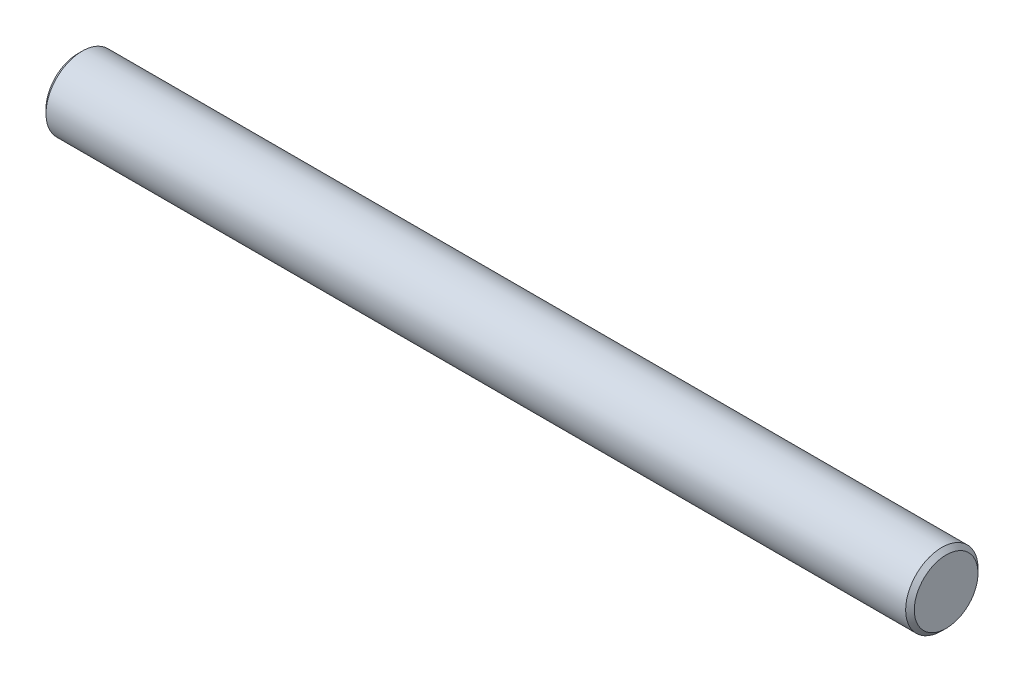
ISO-10303-21;
HEADER;
FILE_DESCRIPTION(('STEP AP214'),'2;1');
FILE_NAME('part.step','',(''),(''),'','','');
FILE_SCHEMA(('AUTOMOTIVE_DESIGN { 1 0 10303 214 1 1 1 1 }'));
ENDSEC;
DATA;
#1=APPLICATION_CONTEXT('core data for automotive mechanical design processes');
#2=APPLICATION_PROTOCOL_DEFINITION('international standard','automotive_design',2000,#1);
#3=PRODUCT_CONTEXT('',#1,'mechanical');
#4=PRODUCT('Part','Part','',(#3));
#5=PRODUCT_RELATED_PRODUCT_CATEGORY('part','',(#4));
#6=PRODUCT_DEFINITION_FORMATION('','',#4);
#7=PRODUCT_DEFINITION_CONTEXT('part definition',#1,'design');
#8=PRODUCT_DEFINITION('design','',#6,#7);
#9=PRODUCT_DEFINITION_SHAPE('','',#8);
#10=(LENGTH_UNIT() NAMED_UNIT(*) SI_UNIT(.MILLI.,.METRE.));
#11=(NAMED_UNIT(*) PLANE_ANGLE_UNIT() SI_UNIT($,.RADIAN.));
#12=(NAMED_UNIT(*) SI_UNIT($,.STERADIAN.) SOLID_ANGLE_UNIT());
#13=UNCERTAINTY_MEASURE_WITH_UNIT(LENGTH_MEASURE(1.E-05),#10,'distance_accuracy_value','');
#14=(GEOMETRIC_REPRESENTATION_CONTEXT(3) GLOBAL_UNCERTAINTY_ASSIGNED_CONTEXT((#13)) GLOBAL_UNIT_ASSIGNED_CONTEXT((#10,
#11,#12)) REPRESENTATION_CONTEXT('',''));
#15=CARTESIAN_POINT('',(0.,0.,0.));
#16=DIRECTION('',(0.,0.,1.));
#17=DIRECTION('',(1.,0.,0.));
#18=AXIS2_PLACEMENT_3D('',#15,#16,#17);
#19=CARTESIAN_POINT('',(-36.5,0.,0.));
#20=DIRECTION('',(-1.,0.,0.));
#21=DIRECTION('',(0.,0.,1.));
#22=AXIS2_PLACEMENT_3D('',#19,#20,#21);
#23=PLANE('',#22);
#24=DIRECTION('',(0.,1.,0.));
#25=VECTOR('',#24,1.);
#26=CARTESIAN_POINT('',(-36.5,4.68766927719,-2.));
#27=LINE('',#26,#25);
#28=CARTESIAN_POINT('',(-36.5000000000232,-0.640312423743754,-2.));
#29=VERTEX_POINT('',#28);
#30=CARTESIAN_POINT('',(-36.5000000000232,0.640312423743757,-2.));
#31=VERTEX_POINT('',#30);
#32=EDGE_CURVE('E82',#29,#31,#27,.T.);
#33=ORIENTED_EDGE('',*,*,#32,.T.);
#34=CARTESIAN_POINT('',(-36.5000000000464,0.,0.));
#35=DIRECTION('',(1.,0.,0.));
#36=DIRECTION('',(0.,1.,0.));
#37=AXIS2_PLACEMENT_3D('',#34,#35,#36);
#38=CIRCLE('',#37,2.09999999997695);
#39=EDGE_CURVE('E86',#29,#31,#38,.T.);
#40=ORIENTED_EDGE('',*,*,#39,.F.);
#41=EDGE_LOOP('',(#33,#40));
#42=FACE_BOUND('',#41,.T.);
#43=ADVANCED_FACE('F17',(#42),#23,.T.);
#44=CARTESIAN_POINT('',(-54.4,0.,-1.9));
#45=DIRECTION('',(0.,-1.,0.));
#46=DIRECTION('',(0.,0.,-1.));
#47=AXIS2_PLACEMENT_3D('',#44,#45,#46);
#48=CYLINDRICAL_SURFACE('',#47,0.100000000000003);
#49=CARTESIAN_POINT('',(-54.5,-1.10905365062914,-1.8999999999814));
#50=CARTESIAN_POINT('',(-54.4999996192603,-1.10528439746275,-1.90220049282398));
#51=CARTESIAN_POINT('',(-54.4999279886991,-1.10154803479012,-1.90444940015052));
#52=CARTESIAN_POINT('',(-54.4996140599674,-1.09413969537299,-1.90907725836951));
#53=CARTESIAN_POINT('',(-54.4993709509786,-1.09046810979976,-1.91145677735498));
#54=CARTESIAN_POINT('',(-54.4983074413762,-1.07923080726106,-1.9190607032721));
#55=CARTESIAN_POINT('',(-54.4971460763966,-1.07183473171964,-1.92452922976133));
#56=CARTESIAN_POINT('',(-54.4943170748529,-1.06166897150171,-1.933368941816));
#57=CARTESIAN_POINT('',(-54.4932041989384,-1.0584540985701,-1.93639871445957));
#58=CARTESIAN_POINT('',(-54.4904902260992,-1.05255519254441,-1.94269843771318));
#59=CARTESIAN_POINT('',(-54.4888957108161,-1.04986476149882,-1.94596472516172));
#60=CARTESIAN_POINT('',(-54.4860665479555,-1.0465649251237,-1.9509500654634));
#61=CARTESIAN_POINT('',(-54.4850843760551,-1.04560562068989,-1.95257839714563));
#62=CARTESIAN_POINT('',(-54.4829602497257,-1.04395447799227,-1.95586976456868));
#63=CARTESIAN_POINT('',(-54.4818183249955,-1.04326259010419,-1.95753279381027));
#64=CARTESIAN_POINT('',(-54.4793665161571,-1.042209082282,-1.96087095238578));
#65=CARTESIAN_POINT('',(-54.4780550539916,-1.04185086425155,-1.96254603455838));
#66=CARTESIAN_POINT('',(-54.4753061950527,-1.0415262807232,-1.96582969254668));
#67=CARTESIAN_POINT('',(-54.4738688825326,-1.04155965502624,-1.96743831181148));
#68=CARTESIAN_POINT('',(-54.471081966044,-1.04199043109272,-1.97036335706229));
#69=CARTESIAN_POINT('',(-54.4697394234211,-1.04234851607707,-1.97169263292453));
#70=CARTESIAN_POINT('',(-54.4670377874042,-1.04333857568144,-1.9742251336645));
#71=CARTESIAN_POINT('',(-54.4656786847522,-1.04397071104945,-1.97542828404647));
#72=CARTESIAN_POINT('',(-54.4623195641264,-1.04581955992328,-1.97825054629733));
#73=CARTESIAN_POINT('',(-54.4603272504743,-1.04717114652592,-1.97978966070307));
#74=CARTESIAN_POINT('',(-54.4564182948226,-1.0502169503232,-1.98260023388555));
#75=CARTESIAN_POINT('',(-54.4545018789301,-1.05191211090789,-1.98387093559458));
#76=CARTESIAN_POINT('',(-54.4491929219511,-1.05704280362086,-1.98715793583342));
#77=CARTESIAN_POINT('',(-54.4459037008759,-1.06074982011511,-1.98891107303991));
#78=CARTESIAN_POINT('',(-54.4395708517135,-1.06858133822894,-1.99190402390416));
#79=CARTESIAN_POINT('',(-54.4365291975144,-1.07270869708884,-1.99313998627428));
#80=CARTESIAN_POINT('',(-54.4271300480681,-1.08627204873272,-1.99649703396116));
#81=CARTESIAN_POINT('',(-54.4211613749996,-1.09614901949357,-1.99790683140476));
#82=CARTESIAN_POINT('',(-54.412789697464,-1.11107499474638,-1.99921492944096));
#83=CARTESIAN_POINT('',(-54.4101402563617,-1.11597663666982,-1.99951788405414));
#84=CARTESIAN_POINT('',(-54.4049774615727,-1.12583572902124,-1.99990993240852));
#85=CARTESIAN_POINT('',(-54.4024636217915,-1.13079289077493,-1.99999984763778));
#86=CARTESIAN_POINT('',(-54.400000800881,-1.13578004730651,-1.9999999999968));
#87=B_SPLINE_CURVE_WITH_KNOTS('',3,(#49,#50,#51,#52,#53,#54,#55,#56,#57,#58,#59,#60,#61,#62,#63,
#64,#65,#66,#67,#68,#69,#70,#71,#72,#73,#74,#75,#76,#77,#78,#79,#80,#81,#82,#83,#84,#85,#86),
.UNSPECIFIED.,.F.,.F.,(4,2,2,2,2,2,2,2,2,2,2,2,2,2,2,2,2,2,4),(0.,0.0130836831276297,
0.0262296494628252,0.053869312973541,0.0675030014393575,0.0809582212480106,0.0873298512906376,
0.0937002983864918,0.100135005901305,0.106565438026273,0.112308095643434,0.118054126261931,
0.126577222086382,0.135124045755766,0.150806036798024,0.166602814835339,0.201307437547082,
0.218047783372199,0.23472347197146),.UNSPECIFIED.);
#88=CARTESIAN_POINT('',(-54.5000000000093,-1.10905365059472,-1.8999999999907));
#89=VERTEX_POINT('',#88);
#90=CARTESIAN_POINT('',(-54.400000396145,-1.13578086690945,-1.99999999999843));
#91=VERTEX_POINT('',#90);
#92=EDGE_CURVE('E76',#89,#91,#87,.T.);
#93=ORIENTED_EDGE('',*,*,#92,.F.);
#94=DIRECTION('',(0.,1.,0.));
#95=VECTOR('',#94,1.);
#96=CARTESIAN_POINT('',(-54.5,0.,-1.9));
#97=LINE('',#96,#95);
#98=CARTESIAN_POINT('',(-54.5000000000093,1.10905365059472,-1.8999999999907));
#99=VERTEX_POINT('',#98);
#100=EDGE_CURVE('E74',#89,#99,#97,.T.);
#101=ORIENTED_EDGE('',*,*,#100,.T.);
#102=CARTESIAN_POINT('',(-54.4000007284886,1.13578003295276,-1.99999985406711));
#103=CARTESIAN_POINT('',(-54.404429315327,1.12688510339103,-1.99996156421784));
#104=CARTESIAN_POINT('',(-54.4090022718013,1.1179999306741,-1.99970077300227));
#105=CARTESIAN_POINT('',(-54.4186286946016,1.10053508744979,-1.99838138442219));
#106=CARTESIAN_POINT('',(-54.4236833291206,1.09195623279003,-1.99732080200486));
#107=CARTESIAN_POINT('',(-54.4314669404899,1.08000819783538,-1.99495193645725));
#108=CARTESIAN_POINT('',(-54.4339349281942,1.07638329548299,-1.99410554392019));
#109=CARTESIAN_POINT('',(-54.4390456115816,1.06931983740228,-1.99210358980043));
#110=CARTESIAN_POINT('',(-54.4416889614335,1.06588207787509,-1.99094681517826));
#111=CARTESIAN_POINT('',(-54.4472213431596,1.05927442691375,-1.98820385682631));
#112=CARTESIAN_POINT('',(-54.4501138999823,1.05611036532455,-1.98661042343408));
#113=CARTESIAN_POINT('',(-54.456117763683,1.05039968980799,-1.98284410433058));
#114=CARTESIAN_POINT('',(-54.4592269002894,1.04784784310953,-1.98067648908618));
#115=CARTESIAN_POINT('',(-54.4638246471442,1.04495581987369,-1.9770047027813));
#116=CARTESIAN_POINT('',(-54.4652633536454,1.0441713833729,-1.9757919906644));
#117=CARTESIAN_POINT('',(-54.4681376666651,1.04288910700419,-1.97321863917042));
#118=CARTESIAN_POINT('',(-54.4695732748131,1.0423910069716,-1.97185813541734));
#119=CARTESIAN_POINT('',(-54.4724083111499,1.04172974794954,-1.96900076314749));
#120=CARTESIAN_POINT('',(-54.4738074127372,1.0415689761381,-1.96750300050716));
#121=CARTESIAN_POINT('',(-54.4765080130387,1.04160811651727,-1.96442604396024));
#122=CARTESIAN_POINT('',(-54.4778094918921,1.04180810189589,-1.96284683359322));
#123=CARTESIAN_POINT('',(-54.4801816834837,1.04251291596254,-1.95978599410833));
#124=CARTESIAN_POINT('',(-54.4812624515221,1.04299305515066,-1.95830622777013));
#125=CARTESIAN_POINT('',(-54.4832981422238,1.04419315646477,-1.95535911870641));
#126=CARTESIAN_POINT('',(-54.4842530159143,1.04491321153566,-1.9538917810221));
#127=CARTESIAN_POINT('',(-54.4866540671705,1.04710607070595,-1.94999349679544));
#128=CARTESIAN_POINT('',(-54.4879870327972,1.04875615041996,-1.94759317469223));
#129=CARTESIAN_POINT('',(-54.490357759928,1.05241507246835,-1.94292276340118));
#130=CARTESIAN_POINT('',(-54.4913944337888,1.05442519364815,-1.94065317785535));
#131=CARTESIAN_POINT('',(-54.4940953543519,1.06067324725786,-1.93417149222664));
#132=CARTESIAN_POINT('',(-54.4954347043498,1.06523057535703,-1.93013674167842));
#133=CARTESIAN_POINT('',(-54.4975310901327,1.07477203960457,-1.92243892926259));
#134=CARTESIAN_POINT('',(-54.4982858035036,1.07975779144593,-1.91877739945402));
#135=CARTESIAN_POINT('',(-54.4992471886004,1.08880152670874,-1.91254981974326));
#136=CARTESIAN_POINT('',(-54.4995397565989,1.0928106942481,-1.90992484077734));
#137=CARTESIAN_POINT('',(-54.4999139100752,1.10088843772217,-1.90484804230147));
#138=CARTESIAN_POINT('',(-54.4999976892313,1.1049559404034,-1.90239468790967));
#139=CARTESIAN_POINT('',(-54.5,1.10905365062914,-1.8999999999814));
#140=B_SPLINE_CURVE_WITH_KNOTS('',3,(#102,#103,#104,#105,#106,#107,#108,#109,#110,#111,#112,
#113,#114,#115,#116,#117,#118,#119,#120,#121,#122,#123,#124,#125,#126,#127,#128,#129,#130,#131,
#132,#133,#134,#135,#136,#137,#138,#139),.UNSPECIFIED.,.F.,.F.,(4,2,2,2,2,2,2,2,2,2,2,2,2,2,2,2,
2,2,4),(0.,0.0298987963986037,0.0598720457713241,0.0732579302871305,0.0866969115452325,
0.100374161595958,0.113929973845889,0.120024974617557,0.126114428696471,0.132246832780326,
0.138380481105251,0.144041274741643,0.149704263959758,0.159258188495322,0.168846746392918,
0.187439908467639,0.206106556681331,0.220501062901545,0.234743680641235),.UNSPECIFIED.);
#141=CARTESIAN_POINT('',(-54.4000007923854,1.13578006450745,-1.99999999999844));
#142=VERTEX_POINT('',#141);
#143=EDGE_CURVE('E20',#142,#99,#140,.T.);
#144=ORIENTED_EDGE('',*,*,#143,.F.);
#145=DIRECTION('',(0.,1.,0.));
#146=VECTOR('',#145,1.);
#147=CARTESIAN_POINT('',(-54.4,4.68766927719,-2.));
#148=LINE('',#147,#146);
#149=EDGE_CURVE('E71',#142,#91,#148,.F.);
#150=ORIENTED_EDGE('',*,*,#149,.T.);
#151=EDGE_LOOP('',(#93,#101,#144,#150));
#152=FACE_BOUND('',#151,.T.);
#153=ADVANCED_FACE('F69',(#152),#48,.T.);
#154=CARTESIAN_POINT('',(5.5,0.,0.));
#155=DIRECTION('',(1.,0.,0.));
#156=DIRECTION('',(0.,0.,-1.));
#157=AXIS2_PLACEMENT_3D('',#154,#155,#156);
#158=PLANE('',#157);
#159=CARTESIAN_POINT('',(5.50000000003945,0.,0.));
#160=DIRECTION('',(-1.,0.,0.));
#161=DIRECTION('',(0.,0.,1.));
#162=AXIS2_PLACEMENT_3D('',#159,#160,#161);
#163=CIRCLE('',#162,2.20000000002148);
#164=CARTESIAN_POINT('',(5.50000000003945,0.,2.20000000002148));
#165=VERTEX_POINT('',#164);
#166=EDGE_CURVE('E105',#165,#165,#163,.T.);
#167=ORIENTED_EDGE('',*,*,#166,.F.);
#168=EDGE_LOOP('',(#167));
#169=FACE_BOUND('',#168,.T.);
#170=ADVANCED_FACE('F128',(#169),#158,.T.);
#171=CARTESIAN_POINT('',(-54.5,4.68766927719,-2.));
#172=DIRECTION('',(0.,0.,1.));
#173=DIRECTION('',(1.,0.,0.));
#174=AXIS2_PLACEMENT_3D('',#171,#172,#173);
#175=PLANE('',#174);
#176=CARTESIAN_POINT('',(-54.199999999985,1.49999999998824,-2.));
#177=CARTESIAN_POINT('',(-54.2178221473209,1.47029443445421,-2.));
#178=CARTESIAN_POINT('',(-54.2353974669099,1.44043945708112,-2.));
#179=CARTESIAN_POINT('',(-54.2699867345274,1.38042279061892,-2.));
#180=CARTESIAN_POINT('',(-54.2870009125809,1.35026123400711,-2.));
#181=CARTESIAN_POINT('',(-54.3204159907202,1.28959723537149,-2.));
#182=CARTESIAN_POINT('',(-54.3368168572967,1.2590947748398,-2.));
#183=CARTESIAN_POINT('',(-54.3689388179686,1.19771815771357,-2.));
#184=CARTESIAN_POINT('',(-54.3846596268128,1.16684385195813,-2.));
#185=CARTESIAN_POINT('',(-54.4000007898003,1.13578006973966,-2.));
#186=B_SPLINE_CURVE_WITH_KNOTS('',3,(#176,#177,#178,#179,#180,#181,#182,#183,#184,#185),
.UNSPECIFIED.,.F.,.F.,(4,2,2,2,4),(0.,0.103925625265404,0.207808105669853,0.311696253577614,
0.415627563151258),.UNSPECIFIED.);
#187=CARTESIAN_POINT('',(-54.1999999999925,1.49999999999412,-2.));
#188=VERTEX_POINT('',#187);
#189=EDGE_CURVE('E78',#188,#142,#186,.T.);
#190=ORIENTED_EDGE('',*,*,#189,.F.);
#191=DIRECTION('',(1.,0.,0.));
#192=VECTOR('',#191,1.);
#193=CARTESIAN_POINT('',(-24.5,1.5,-2.));
#194=LINE('',#193,#192);
#195=CARTESIAN_POINT('',(-36.1000000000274,1.5,-2.));
#196=VERTEX_POINT('',#195);
#197=EDGE_CURVE('E98',#196,#188,#194,.F.);
#198=ORIENTED_EDGE('',*,*,#197,.F.);
#199=CARTESIAN_POINT('',(-36.5000000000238,0.640312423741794,-2.));
#200=CARTESIAN_POINT('',(-36.4768060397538,0.7163098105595,-2.));
#201=CARTESIAN_POINT('',(-36.4502555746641,0.791179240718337,-2.));
#202=CARTESIAN_POINT('',(-36.3917903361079,0.938492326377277,-2.));
#203=CARTESIAN_POINT('',(-36.3598955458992,1.01094385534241,-2.));
#204=CARTESIAN_POINT('',(-36.2919375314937,1.15373218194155,-2.));
#205=CARTESIAN_POINT('',(-36.2558786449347,1.22407108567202,-2.));
#206=CARTESIAN_POINT('',(-36.1802991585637,1.36320578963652,-2.));
#207=CARTESIAN_POINT('',(-36.1407663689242,1.43199499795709,-2.));
#208=CARTESIAN_POINT('',(-36.1000000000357,1.50000000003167,-2.));
#209=B_SPLINE_CURVE_WITH_KNOTS('',3,(#199,#200,#201,#202,#203,#204,#205,#206,#207,#208),
.UNSPECIFIED.,.F.,.F.,(4,2,2,2,4),(0.,0.238153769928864,0.475436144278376,0.712473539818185,
0.950378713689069),.UNSPECIFIED.);
#210=EDGE_CURVE('E89',#31,#196,#209,.T.);
#211=ORIENTED_EDGE('',*,*,#210,.F.);
#212=ORIENTED_EDGE('',*,*,#32,.F.);
#213=CARTESIAN_POINT('',(-36.1000000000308,-1.50000000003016,-1.99999999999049));
#214=CARTESIAN_POINT('',(-36.1407663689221,-1.43199499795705,-1.99999999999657));
#215=CARTESIAN_POINT('',(-36.1802991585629,-1.36320578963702,-1.99999999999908));
#216=CARTESIAN_POINT('',(-36.2558786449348,-1.22407108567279,-2.00000000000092));
#217=CARTESIAN_POINT('',(-36.2919375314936,-1.15373218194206,-2.00000000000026));
#218=CARTESIAN_POINT('',(-36.359895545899,-1.01094385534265,-1.99999999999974));
#219=CARTESIAN_POINT('',(-36.3917903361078,-0.938492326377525,-1.99999999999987));
#220=CARTESIAN_POINT('',(-36.4502555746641,-0.791179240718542,-2.00000000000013));
#221=CARTESIAN_POINT('',(-36.4768060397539,-0.716309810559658,-2.00000000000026));
#222=CARTESIAN_POINT('',(-36.5000000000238,-0.640312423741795,-2.));
#223=B_SPLINE_CURVE_WITH_KNOTS('',3,(#213,#214,#215,#216,#217,#218,#219,#220,#221,#222),
.UNSPECIFIED.,.F.,.F.,(4,2,2,2,4),(0.,0.237905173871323,0.474942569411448,0.712224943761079,
0.95037871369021),.UNSPECIFIED.);
#224=CARTESIAN_POINT('',(-36.1000000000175,-1.50000000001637,-2.));
#225=VERTEX_POINT('',#224);
#226=EDGE_CURVE('E40',#225,#29,#223,.T.);
#227=ORIENTED_EDGE('',*,*,#226,.F.);
#228=DIRECTION('',(1.,0.,0.));
#229=VECTOR('',#228,1.);
#230=CARTESIAN_POINT('',(-24.5,-1.5,-2.));
#231=LINE('',#230,#229);
#232=CARTESIAN_POINT('',(-54.1999999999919,-1.49999999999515,-2.));
#233=VERTEX_POINT('',#232);
#234=EDGE_CURVE('E94',#233,#225,#231,.T.);
#235=ORIENTED_EDGE('',*,*,#234,.F.);
#236=CARTESIAN_POINT('',(-54.4000007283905,-1.13578003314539,-1.99999985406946));
#237=CARTESIAN_POINT('',(-54.3846596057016,-1.16684383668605,-1.99999994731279));
#238=CARTESIAN_POINT('',(-54.3689388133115,-1.19771815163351,-1.9999999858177));
#239=CARTESIAN_POINT('',(-54.336816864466,-1.25909477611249,-2.00000001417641));
#240=CARTESIAN_POINT('',(-54.3204159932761,-1.28959723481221,-2.00000000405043));
#241=CARTESIAN_POINT('',(-54.2870009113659,-1.35026123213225,-1.99999999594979));
#242=CARTESIAN_POINT('',(-54.2699867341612,-1.38042278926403,-1.99999999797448));
#243=CARTESIAN_POINT('',(-54.2353974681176,-1.44043945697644,-2.00000000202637));
#244=CARTESIAN_POINT('',(-54.2178221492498,-1.47029443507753,-2.00000000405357));
#245=CARTESIAN_POINT('',(-54.1999999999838,-1.49999999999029,-2.));
#246=B_SPLINE_CURVE_WITH_KNOTS('',3,(#236,#237,#238,#239,#240,#241,#242,#243,#244,#245),
.UNSPECIFIED.,.F.,.F.,(4,2,2,2,4),(0.,0.103931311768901,0.207819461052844,0.311701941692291,
0.415627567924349),.UNSPECIFIED.);
#247=EDGE_CURVE('E85',#91,#233,#246,.T.);
#248=ORIENTED_EDGE('',*,*,#247,.F.);
#249=ORIENTED_EDGE('',*,*,#149,.F.);
#250=EDGE_LOOP('',(#190,#198,#211,#212,#227,#235,#248,#249));
#251=FACE_BOUND('',#250,.T.);
#252=ADVANCED_FACE('F84',(#251),#175,.F.);
#253=CARTESIAN_POINT('',(-36.1000000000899,0.,0.));
#254=DIRECTION('',(1.,0.,0.));
#255=DIRECTION('',(0.,1.,0.));
#256=AXIS2_PLACEMENT_3D('',#253,#254,#255);
#257=CONICAL_SURFACE('',#256,2.49999999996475,0.785398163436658);
#258=CARTESIAN_POINT('',(-36.1,0.,0.));
#259=DIRECTION('',(1.,0.,0.));
#260=DIRECTION('',(0.,0.,-1.));
#261=AXIS2_PLACEMENT_3D('',#258,#259,#260);
#262=CIRCLE('',#261,2.5);
#263=EDGE_CURVE('E97',#225,#196,#262,.T.);
#264=ORIENTED_EDGE('',*,*,#263,.F.);
#265=ORIENTED_EDGE('',*,*,#226,.T.);
#266=ORIENTED_EDGE('',*,*,#39,.T.);
#267=ORIENTED_EDGE('',*,*,#210,.T.);
#268=EDGE_LOOP('',(#264,#265,#266,#267));
#269=FACE_BOUND('',#268,.T.);
#270=ADVANCED_FACE('F122',(#269),#257,.T.);
#271=CARTESIAN_POINT('',(-54.5,0.,0.));
#272=DIRECTION('',(1.,0.,0.));
#273=DIRECTION('',(0.,0.,-1.));
#274=AXIS2_PLACEMENT_3D('',#271,#272,#273);
#275=PLANE('',#274);
#276=ORIENTED_EDGE('',*,*,#100,.F.);
#277=CARTESIAN_POINT('',(-54.5000000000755,0.,0.));
#278=DIRECTION('',(1.,0.,0.));
#279=DIRECTION('',(0.,0.,-1.));
#280=AXIS2_PLACEMENT_3D('',#277,#278,#279);
#281=CIRCLE('',#280,2.20000000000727);
#282=EDGE_CURVE('E100',#99,#89,#281,.T.);
#283=ORIENTED_EDGE('',*,*,#282,.F.);
#284=EDGE_LOOP('',(#276,#283));
#285=FACE_BOUND('',#284,.T.);
#286=ADVANCED_FACE('F170',(#285),#275,.F.);
#287=CARTESIAN_POINT('',(5.20000000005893,0.,0.));
#288=DIRECTION('',(-1.,0.,0.));
#289=DIRECTION('',(0.,0.,1.));
#290=AXIS2_PLACEMENT_3D('',#287,#288,#289);
#291=CONICAL_SURFACE('',#290,2.50000000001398,0.785398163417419);
#292=CARTESIAN_POINT('',(5.2,0.,0.));
#293=DIRECTION('',(1.,0.,0.));
#294=DIRECTION('',(0.,0.,-1.));
#295=AXIS2_PLACEMENT_3D('',#292,#293,#294);
#296=CIRCLE('',#295,2.5);
#297=CARTESIAN_POINT('',(5.2,0.,-2.5));
#298=VERTEX_POINT('',#297);
#299=EDGE_CURVE('E31',#298,#298,#296,.F.);
#300=ORIENTED_EDGE('',*,*,#299,.F.);
#301=EDGE_LOOP('',(#300));
#302=FACE_BOUND('',#301,.T.);
#303=ORIENTED_EDGE('',*,*,#166,.T.);
#304=EDGE_LOOP('',(#303));
#305=FACE_BOUND('',#304,.T.);
#306=ADVANCED_FACE('F165',(#302,#305),#291,.T.);
#307=CARTESIAN_POINT('',(-54.200000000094,0.,0.));
#308=DIRECTION('',(1.,0.,0.));
#309=DIRECTION('',(0.,0.,-1.));
#310=AXIS2_PLACEMENT_3D('',#307,#308,#309);
#311=CONICAL_SURFACE('',#310,2.49999999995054,0.785398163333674);
#312=ORIENTED_EDGE('',*,*,#282,.T.);
#313=ORIENTED_EDGE('',*,*,#92,.T.);
#314=ORIENTED_EDGE('',*,*,#247,.T.);
#315=CARTESIAN_POINT('',(-54.2,0.,0.));
#316=DIRECTION('',(1.,0.,0.));
#317=DIRECTION('',(0.,0.,-1.));
#318=AXIS2_PLACEMENT_3D('',#315,#316,#317);
#319=CIRCLE('',#318,2.5);
#320=EDGE_CURVE('E11',#188,#233,#319,.T.);
#321=ORIENTED_EDGE('',*,*,#320,.F.);
#322=ORIENTED_EDGE('',*,*,#189,.T.);
#323=ORIENTED_EDGE('',*,*,#143,.T.);
#324=EDGE_LOOP('',(#312,#313,#314,#321,#322,#323));
#325=FACE_BOUND('',#324,.T.);
#326=ADVANCED_FACE('F79',(#325),#311,.T.);
#327=CARTESIAN_POINT('',(-24.5,0.,0.));
#328=DIRECTION('',(1.,0.,0.));
#329=DIRECTION('',(0.,0.,-1.));
#330=AXIS2_PLACEMENT_3D('',#327,#328,#329);
#331=CYLINDRICAL_SURFACE('',#330,2.5);
#332=ORIENTED_EDGE('',*,*,#299,.T.);
#333=EDGE_LOOP('',(#332));
#334=FACE_BOUND('',#333,.T.);
#335=ORIENTED_EDGE('',*,*,#320,.T.);
#336=ORIENTED_EDGE('',*,*,#234,.T.);
#337=ORIENTED_EDGE('',*,*,#263,.T.);
#338=ORIENTED_EDGE('',*,*,#197,.T.);
#339=EDGE_LOOP('',(#335,#336,#337,#338));
#340=FACE_BOUND('',#339,.T.);
#341=ADVANCED_FACE('F158',(#334,#340),#331,.T.);
#342=CLOSED_SHELL('',(#43,#153,#170,#252,#270,#286,#306,#326,#341));
#343=MANIFOLD_SOLID_BREP('B1',#342);
#344=ADVANCED_BREP_SHAPE_REPRESENTATION('',(#18,#343),#14);
#345=SHAPE_DEFINITION_REPRESENTATION(#9,#344);
ENDSEC;
END-ISO-10303-21;
